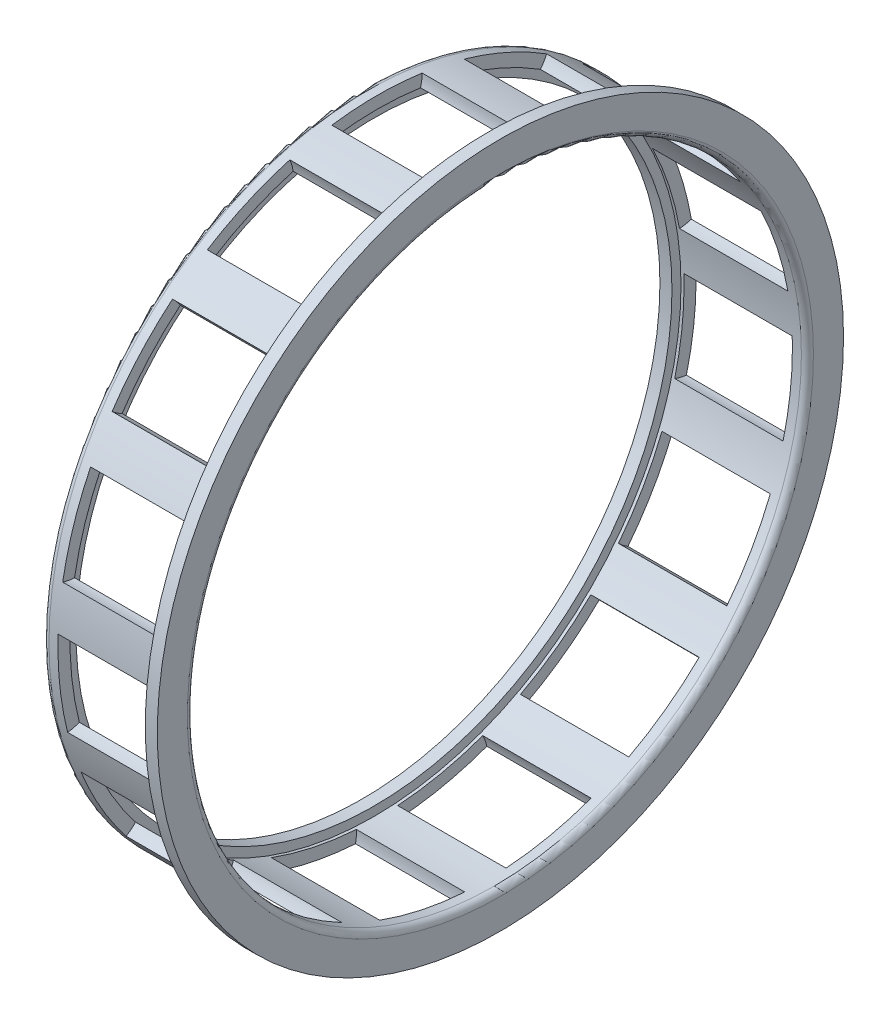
from build123d import *

# Parameters (mm, degrees)
CONG_1_R                     = 0.2
ESQUISSE3_W                  = 3.6
ESQUISSE3_H                  = 1.5
R_P_TITION_CIRCULAIRE1_COUNT = 15


with BuildPart() as part:
    # Esquisse1 → Base-R_vol.-Mince (revolve)
    with BuildSketch(Plane.XY, mode=Mode.PRIVATE) as base_r_vol_mince_sk:
        Polygon((0, 9.9), (0, 10.6), (4.2, 10.6), (4.2, 11.4), (4.6, 11.4), (4.6, 10.2), (0.4, 10.2), (0.4, 9.9), align=None)
    revolve(base_r_vol_mince_sk.sketch.rotate(Axis((-3, 0, 0), (1, 0, 0)), 270), axis=Axis((-3, 0, 0), (1, 0, 0)))

    # Cong_1
    cong_1_edges = [part.edges().sort_by_distance(p)[0] for p in [
        (0, 0, 10.6),
        (4.6, 0, 10.2),
    ]]
    fillet(cong_1_edges, radius=CONG_1_R)

    # Esquisse3 → Enlever de la mati_re-Pivoter1 (revolve, cut)
    with BuildSketch(Plane.XY):
        with Locations((2.3, 11.25)):
            Rectangle(ESQUISSE3_W, ESQUISSE3_H)
    enlever_de_la_mati_re_pivoter1 = revolve(axis=Axis((-0.3, 10.5, 0), (1, 0, 0)), mode=Mode.SUBTRACT)

    # R_p_tition circulaire1: Enlever de la mati_re-Pivoter1 ×15 about axis
    r_p_tition_circulaire1_axis = Axis((-3, 0, 0), (1, 0, 0))
    for i in range(1, R_P_TITION_CIRCULAIRE1_COUNT):
        add(enlever_de_la_mati_re_pivoter1.rotate(r_p_tition_circulaire1_axis, i * 360 / R_P_TITION_CIRCULAIRE1_COUNT), mode=Mode.SUBTRACT)


solid = part.part
